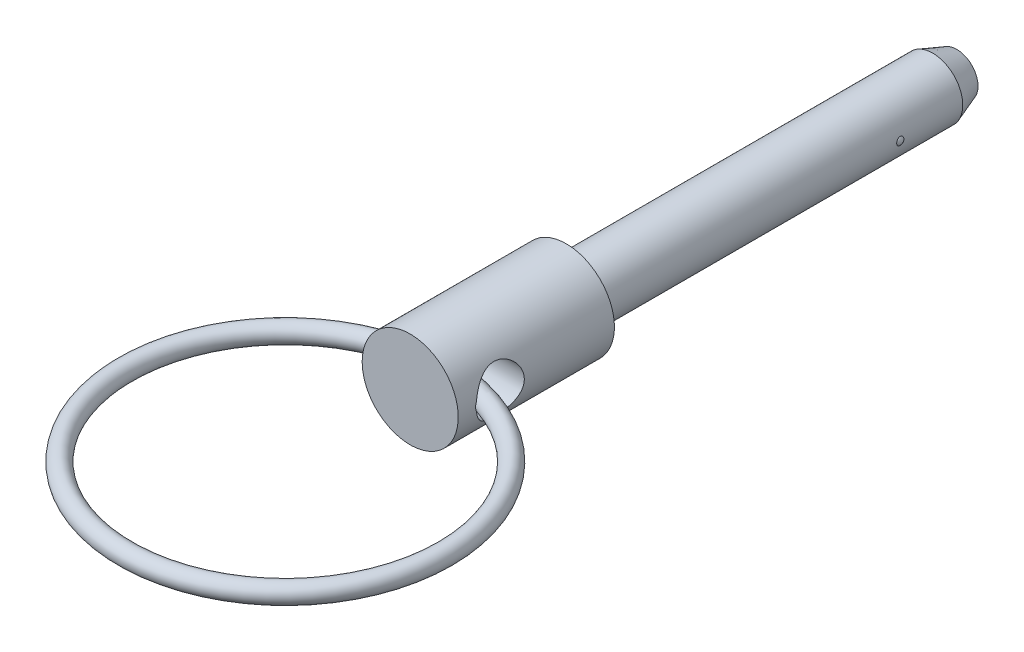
ISO-10303-21;
HEADER;
FILE_DESCRIPTION(('STEP AP214'),'2;1');
FILE_NAME('part.step','',(''),(''),'','','');
FILE_SCHEMA(('AUTOMOTIVE_DESIGN { 1 0 10303 214 1 1 1 1 }'));
ENDSEC;
DATA;
#1=APPLICATION_CONTEXT('core data for automotive mechanical design processes');
#2=APPLICATION_PROTOCOL_DEFINITION('international standard','automotive_design',2000,#1);
#3=PRODUCT_CONTEXT('',#1,'mechanical');
#4=PRODUCT('Part','Part','',(#3));
#5=PRODUCT_RELATED_PRODUCT_CATEGORY('part','',(#4));
#6=PRODUCT_DEFINITION_FORMATION('','',#4);
#7=PRODUCT_DEFINITION_CONTEXT('part definition',#1,'design');
#8=PRODUCT_DEFINITION('design','',#6,#7);
#9=PRODUCT_DEFINITION_SHAPE('','',#8);
#10=(LENGTH_UNIT() NAMED_UNIT(*) SI_UNIT(.MILLI.,.METRE.));
#11=(NAMED_UNIT(*) PLANE_ANGLE_UNIT() SI_UNIT($,.RADIAN.));
#12=(NAMED_UNIT(*) SI_UNIT($,.STERADIAN.) SOLID_ANGLE_UNIT());
#13=UNCERTAINTY_MEASURE_WITH_UNIT(LENGTH_MEASURE(1.E-05),#10,'distance_accuracy_value','');
#14=(GEOMETRIC_REPRESENTATION_CONTEXT(3) GLOBAL_UNCERTAINTY_ASSIGNED_CONTEXT((#13)) GLOBAL_UNIT_ASSIGNED_CONTEXT((#10,
#11,#12)) REPRESENTATION_CONTEXT('',''));
#15=CARTESIAN_POINT('',(0.,0.,0.));
#16=DIRECTION('',(0.,0.,1.));
#17=DIRECTION('',(1.,0.,0.));
#18=AXIS2_PLACEMENT_3D('',#15,#16,#17);
#19=CARTESIAN_POINT('',(0.,0.,14.9758741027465));
#20=DIRECTION('',(0.,0.,1.));
#21=DIRECTION('',(-1.,0.,0.));
#22=AXIS2_PLACEMENT_3D('',#19,#20,#21);
#23=CYLINDRICAL_SURFACE('',#22,4.00000000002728);
#24=CARTESIAN_POINT('',(0.,0.,12.9999999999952));
#25=DIRECTION('',(0.,0.,1.));
#26=DIRECTION('',(-1.,0.,0.));
#27=AXIS2_PLACEMENT_3D('',#24,#25,#26);
#28=CIRCLE('',#27,4.00000000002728);
#29=CARTESIAN_POINT('',(-4.00000000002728,0.,12.9999999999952));
#30=VERTEX_POINT('',#29);
#31=EDGE_CURVE('E61',#30,#30,#28,.T.);
#32=ORIENTED_EDGE('',*,*,#31,.F.);
#33=EDGE_LOOP('',(#32));
#34=FACE_BOUND('',#33,.T.);
#35=CARTESIAN_POINT('',(0.,0.,2.90531487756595E-11));
#36=DIRECTION('',(0.,0.,1.));
#37=DIRECTION('',(-1.,0.,0.));
#38=AXIS2_PLACEMENT_3D('',#35,#36,#37);
#39=CIRCLE('',#38,4.00000000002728);
#40=CARTESIAN_POINT('',(-4.00000000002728,0.,2.90531487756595E-11));
#41=VERTEX_POINT('',#40);
#42=EDGE_CURVE('E114',#41,#41,#39,.T.);
#43=ORIENTED_EDGE('',*,*,#42,.T.);
#44=EDGE_LOOP('',(#43));
#45=FACE_BOUND('',#44,.T.);
#46=CARTESIAN_POINT('',(3.99005038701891,0.281953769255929,9.92986493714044));
#47=CARTESIAN_POINT('',(3.98710361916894,0.323646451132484,9.94537015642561));
#48=CARTESIAN_POINT('',(3.98358785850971,0.364031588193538,9.96435084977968));
#49=CARTESIAN_POINT('',(3.97580260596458,0.441017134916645,10.008790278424));
#50=CARTESIAN_POINT('',(3.97153248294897,0.47761433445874,10.0342544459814));
#51=CARTESIAN_POINT('',(3.96271650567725,0.545954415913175,10.0909789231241));
#52=CARTESIAN_POINT('',(3.95817071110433,0.577698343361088,10.1222379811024));
#53=CARTESIAN_POINT('',(3.94931125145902,0.635450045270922,10.1896824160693));
#54=CARTESIAN_POINT('',(3.94499753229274,0.661459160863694,10.2258666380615));
#55=CARTESIAN_POINT('',(3.93708131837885,0.707055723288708,10.3020868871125));
#56=CARTESIAN_POINT('',(3.93347801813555,0.726650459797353,10.3421184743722));
#57=CARTESIAN_POINT('',(3.92735611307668,0.759043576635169,10.4249158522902));
#58=CARTESIAN_POINT('',(3.92483759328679,0.771841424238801,10.4676818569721));
#59=CARTESIAN_POINT('',(3.92109281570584,0.79064892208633,10.5555243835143));
#60=CARTESIAN_POINT('',(3.91989028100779,0.79653409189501,10.6006284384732));
#61=CARTESIAN_POINT('',(3.91894269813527,0.801182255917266,10.6912124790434));
#62=CARTESIAN_POINT('',(3.91919799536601,0.79994356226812,10.7366925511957));
#63=CARTESIAN_POINT('',(3.92114297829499,0.79035624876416,10.829192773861));
#64=CARTESIAN_POINT('',(3.92290466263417,0.781650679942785,10.8761742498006));
#65=CARTESIAN_POINT('',(3.92772482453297,0.757055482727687,10.9681516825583));
#66=CARTESIAN_POINT('',(3.93078377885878,0.741163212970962,11.0131469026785));
#67=CARTESIAN_POINT('',(3.93806499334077,0.70148030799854,11.1026764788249));
#68=CARTESIAN_POINT('',(3.94234583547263,0.677274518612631,11.1470226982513));
#69=CARTESIAN_POINT('',(3.95147153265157,0.621820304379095,11.2310343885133));
#70=CARTESIAN_POINT('',(3.95631656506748,0.590569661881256,11.2706983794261));
#71=CARTESIAN_POINT('',(3.9660181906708,0.5214609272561,11.3441933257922));
#72=CARTESIAN_POINT('',(3.97087472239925,0.483570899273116,11.3779944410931));
#73=CARTESIAN_POINT('',(3.97994547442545,0.402125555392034,11.4380257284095));
#74=CARTESIAN_POINT('',(3.98416017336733,0.358574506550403,11.4642615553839));
#75=CARTESIAN_POINT('',(3.99101820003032,0.271145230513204,11.5057266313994));
#76=CARTESIAN_POINT('',(3.99376828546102,0.227643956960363,11.5217298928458));
#77=CARTESIAN_POINT('',(3.9978554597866,0.138347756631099,11.5452375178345));
#78=CARTESIAN_POINT('',(3.99919394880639,0.0925551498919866,11.5527503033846));
#79=CARTESIAN_POINT('',(4.00020492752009,0.00564920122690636,11.5584330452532));
#80=CARTESIAN_POINT('',(4.00005022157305,-0.0354012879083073,11.5575719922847));
#81=CARTESIAN_POINT('',(3.99850330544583,-0.116721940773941,11.5488508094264));
#82=CARTESIAN_POINT('',(3.99711125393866,-0.156992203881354,11.5409915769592));
#83=CARTESIAN_POINT('',(3.99330536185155,-0.23447092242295,11.5190218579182));
#84=CARTESIAN_POINT('',(3.99092186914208,-0.271733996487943,11.5050965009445));
#85=CARTESIAN_POINT('',(3.98537855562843,-0.343596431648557,11.4716692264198));
#86=CARTESIAN_POINT('',(3.98221855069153,-0.378195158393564,11.4521659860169));
#87=CARTESIAN_POINT('',(3.97515535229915,-0.446551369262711,11.4066625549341));
#88=CARTESIAN_POINT('',(3.97121432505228,-0.48005403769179,11.380286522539));
#89=CARTESIAN_POINT('',(3.96314004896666,-0.542697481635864,11.3228119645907));
#90=CARTESIAN_POINT('',(3.95900671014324,-0.57183618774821,11.2917112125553));
#91=CARTESIAN_POINT('',(3.95044956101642,-0.628376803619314,11.2218573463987));
#92=CARTESIAN_POINT('',(3.94604615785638,-0.655204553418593,11.1826362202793));
#93=CARTESIAN_POINT('',(3.93791011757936,-0.702452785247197,11.1004353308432));
#94=CARTESIAN_POINT('',(3.93417778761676,-0.722870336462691,11.0574538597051));
#95=CARTESIAN_POINT('',(3.92755557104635,-0.758058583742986,10.9655943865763));
#96=CARTESIAN_POINT('',(3.92474503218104,-0.77232094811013,10.9165145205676));
#97=CARTESIAN_POINT('',(3.92073635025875,-0.792422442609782,10.8165862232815));
#98=CARTESIAN_POINT('',(3.91953811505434,-0.79826205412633,10.765737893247));
#99=CARTESIAN_POINT('',(3.91896964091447,-0.801049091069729,10.6645522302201));
#100=CARTESIAN_POINT('',(3.91957166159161,-0.798131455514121,10.6142190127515));
#101=CARTESIAN_POINT('',(3.92252995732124,-0.783463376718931,10.5149080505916));
#102=CARTESIAN_POINT('',(3.9248854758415,-0.771716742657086,10.4659297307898));
#103=CARTESIAN_POINT('',(3.93088557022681,-0.740520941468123,10.3740211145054));
#104=CARTESIAN_POINT('',(3.93443961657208,-0.721603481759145,10.3309041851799));
#105=CARTESIAN_POINT('',(3.94243966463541,-0.67652841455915,10.2487285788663));
#106=CARTESIAN_POINT('',(3.94688545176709,-0.650372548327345,10.2096689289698));
#107=CARTESIAN_POINT('',(3.95592540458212,-0.592842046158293,10.138445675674));
#108=CARTESIAN_POINT('',(3.96050463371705,-0.561744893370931,10.1060555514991));
#109=CARTESIAN_POINT('',(3.96946431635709,-0.494471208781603,10.0470379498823));
#110=CARTESIAN_POINT('',(3.97384478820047,-0.458295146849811,10.0204099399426));
#111=CARTESIAN_POINT('',(3.98187371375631,-0.382266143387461,9.97385565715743));
#112=CARTESIAN_POINT('',(3.98552868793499,-0.342451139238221,9.95386848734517));
#113=CARTESIAN_POINT('',(3.9917566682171,-0.259975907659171,9.92075319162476));
#114=CARTESIAN_POINT('',(3.99432946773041,-0.217315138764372,9.90762637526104));
#115=CARTESIAN_POINT('',(3.99811926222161,-0.130195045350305,9.88852098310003));
#116=CARTESIAN_POINT('',(3.99933102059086,-0.0857294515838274,9.88257000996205));
#117=CARTESIAN_POINT('',(4.00024701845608,0.00356373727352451,9.87805708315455));
#118=CARTESIAN_POINT('',(3.9999525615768,0.0483909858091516,9.8794887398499));
#119=CARTESIAN_POINT('',(3.99817522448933,0.125082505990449,9.88829599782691));
#120=CARTESIAN_POINT('',(3.99703656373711,0.157163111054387,9.8939529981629));
#121=CARTESIAN_POINT('',(3.99404982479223,0.220379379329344,9.90907748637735));
#122=CARTESIAN_POINT('',(3.9922017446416,0.251515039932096,9.91854498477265));
#123=CARTESIAN_POINT('',(3.99005038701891,0.281953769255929,9.92986493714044));
#124=B_SPLINE_CURVE_WITH_KNOTS('',3,(#46,#47,#48,#49,#50,#51,#52,#53,#54,#55,#56,#57,#58,#59,
#60,#61,#62,#63,#64,#65,#66,#67,#68,#69,#70,#71,#72,#73,#74,#75,#76,#77,#78,#79,#80,#81,#82,#83,
#84,#85,#86,#87,#88,#89,#90,#91,#92,#93,#94,#95,#96,#97,#98,#99,#100,#101,#102,#103,#104,#105,
#106,#107,#108,#109,#110,#111,#112,#113,#114,#115,#116,#117,#118,#119,#120,#121,#122,#123),
.UNSPECIFIED.,.T.,.F.,(4,2,2,2,2,2,2,2,2,2,2,2,2,2,2,2,2,2,2,2,2,2,2,2,2,2,2,2,2,2,2,2,2,2,2,2,
2,2,4),(0.,0.133622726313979,0.267357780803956,0.40106398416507,0.534738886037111,
0.668261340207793,0.801794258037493,0.937696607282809,1.07363115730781,1.2164509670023,
1.35932331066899,1.5107314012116,1.66218722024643,1.8143926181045,1.96648394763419,
2.1049852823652,2.24334911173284,2.36591145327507,2.488458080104,2.60750142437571,
2.72657302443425,2.85451767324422,2.98252280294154,3.12508196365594,3.26770620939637,
3.42053145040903,3.57334795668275,3.72382188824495,3.87423093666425,4.01516707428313,
4.15606933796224,4.29082406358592,4.42556633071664,4.55903651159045,4.69253216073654,
4.82653969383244,4.96043126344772,5.05798542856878,5.15553986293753),.UNSPECIFIED.);
#125=CARTESIAN_POINT('',(3.98515545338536,0.344290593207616,11.4701431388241));
#126=VERTEX_POINT('',#125);
#127=CARTESIAN_POINT('',(3.9851554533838,-0.344290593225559,11.4701431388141));
#128=VERTEX_POINT('',#127);
#129=EDGE_CURVE('E40',#126,#128,#124,.T.);
#130=ORIENTED_EDGE('',*,*,#129,.F.);
#131=CARTESIAN_POINT('',(3.46410161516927,-2.,9.5));
#132=CARTESIAN_POINT('',(3.46411185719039,-1.99999158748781,9.39578679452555));
#133=CARTESIAN_POINT('',(3.46887633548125,-1.99179963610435,9.29143782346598));
#134=CARTESIAN_POINT('',(3.48724701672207,-1.95944672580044,9.08594482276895));
#135=CARTESIAN_POINT('',(3.50087179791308,-1.93525221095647,8.98480799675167));
#136=CARTESIAN_POINT('',(3.53498701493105,-1.87219981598,8.78909684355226));
#137=CARTESIAN_POINT('',(3.55544089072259,-1.83341988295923,8.69449074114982));
#138=CARTESIAN_POINT('',(3.60085327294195,-1.74253507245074,8.51315154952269));
#139=CARTESIAN_POINT('',(3.62581202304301,-1.6904294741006,8.42641888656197));
#140=CARTESIAN_POINT('',(3.679937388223,-1.56933307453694,8.25538855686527));
#141=CARTESIAN_POINT('',(3.70928127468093,-1.49930407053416,8.1718817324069));
#142=CARTESIAN_POINT('',(3.76743965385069,-1.34650761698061,8.01718321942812));
#143=CARTESIAN_POINT('',(3.79625387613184,-1.26373385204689,7.94599767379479));
#144=CARTESIAN_POINT('',(3.8524295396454,-1.080979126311,7.81326569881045));
#145=CARTESIAN_POINT('',(3.879562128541,-0.980214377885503,7.75269246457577));
#146=CARTESIAN_POINT('',(3.92701512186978,-0.768314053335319,7.64971829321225));
#147=CARTESIAN_POINT('',(3.94733982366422,-0.657185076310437,7.60730588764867));
#148=CARTESIAN_POINT('',(3.97760922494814,-0.436089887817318,7.54499067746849));
#149=CARTESIAN_POINT('',(3.98818960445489,-0.326603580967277,7.52370094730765));
#150=CARTESIAN_POINT('',(4.00015167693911,-0.105141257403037,7.49966776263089));
#151=CARTESIAN_POINT('',(4.00153893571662,0.00683321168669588,7.49691308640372));
#152=CARTESIAN_POINT('',(3.99525963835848,0.21966504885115,7.50949334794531));
#153=CARTESIAN_POINT('',(3.98836991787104,0.320642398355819,7.5232760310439));
#154=CARTESIAN_POINT('',(3.96748490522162,0.51862754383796,7.56576168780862));
#155=CARTESIAN_POINT('',(3.95348908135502,0.615635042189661,7.59446577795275));
#156=CARTESIAN_POINT('',(3.91943166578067,0.804618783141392,7.66616513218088));
#157=CARTESIAN_POINT('',(3.89928883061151,0.896506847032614,7.70935262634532));
#158=CARTESIAN_POINT('',(3.85475291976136,1.07195360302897,7.80852683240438));
#159=CARTESIAN_POINT('',(3.83035832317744,1.15550929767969,7.86451812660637));
#160=CARTESIAN_POINT('',(3.77688788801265,1.32034732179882,7.99379070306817));
#161=CARTESIAN_POINT('',(3.74758751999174,1.40066815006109,8.06820605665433));
#162=CARTESIAN_POINT('',(3.68908681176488,1.54820874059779,8.22917944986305));
#163=CARTESIAN_POINT('',(3.65988656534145,1.6154184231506,8.31574674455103));
#164=CARTESIAN_POINT('',(3.60288312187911,1.73901066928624,8.50529638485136));
#165=CARTESIAN_POINT('',(3.57528639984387,1.79443462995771,8.60897204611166));
#166=CARTESIAN_POINT('',(3.52750900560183,1.88663822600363,8.82587534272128));
#167=CARTESIAN_POINT('',(3.50732060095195,1.92343731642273,8.9390928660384));
#168=CARTESIAN_POINT('',(3.47889271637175,1.97436042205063,9.1624290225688));
#169=CARTESIAN_POINT('',(3.46983311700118,1.99005024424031,9.27208223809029));
#170=CARTESIAN_POINT('',(3.46235838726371,2.00303389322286,9.49280268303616));
#171=CARTESIAN_POINT('',(3.46393573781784,2.00034071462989,9.60386885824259));
#172=CARTESIAN_POINT('',(3.47668673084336,1.97807208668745,9.81130783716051));
#173=CARTESIAN_POINT('',(3.48679175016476,1.96037563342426,9.90795890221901));
#174=CARTESIAN_POINT('',(3.51388043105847,1.91139256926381,10.0967355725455));
#175=CARTESIAN_POINT('',(3.5308663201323,1.88010155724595,10.1888597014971));
#176=CARTESIAN_POINT('',(3.57072444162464,1.80329517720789,10.370822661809));
#177=CARTESIAN_POINT('',(3.59383286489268,1.75718812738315,10.46035803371));
#178=CARTESIAN_POINT('',(3.64312238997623,1.65257412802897,10.6309385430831));
#179=CARTESIAN_POINT('',(3.66930506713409,1.59406080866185,10.7119792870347));
#180=CARTESIAN_POINT('',(3.72575996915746,1.45767433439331,10.8739575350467));
#181=CARTESIAN_POINT('',(3.75613166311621,1.37829054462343,10.9535943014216));
#182=CARTESIAN_POINT('',(3.81468469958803,1.20680899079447,11.0988244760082));
#183=CARTESIAN_POINT('',(3.84286530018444,1.11470694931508,11.1644131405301));
#184=CARTESIAN_POINT('',(3.89482723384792,0.917070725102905,11.2811474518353));
#185=CARTESIAN_POINT('',(3.91847283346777,0.811246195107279,11.3318662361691));
#186=CARTESIAN_POINT('',(3.95766709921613,0.591044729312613,11.4142758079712));
#187=CARTESIAN_POINT('',(3.97322287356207,0.476675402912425,11.4459833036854));
#188=CARTESIAN_POINT('',(3.99335016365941,0.253959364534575,11.4867371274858));
#189=CARTESIAN_POINT('',(3.99879855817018,0.146022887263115,11.4975957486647));
#190=CARTESIAN_POINT('',(4.00084260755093,-0.0702519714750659,11.5016865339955));
#191=CARTESIAN_POINT('',(3.99744136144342,-0.178590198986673,11.4949248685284));
#192=CARTESIAN_POINT('',(3.98267937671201,-0.385075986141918,11.4651671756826));
#193=CARTESIAN_POINT('',(3.97185789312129,-0.483424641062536,11.4432702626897));
#194=CARTESIAN_POINT('',(3.94384187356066,-0.674891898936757,11.3853460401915));
#195=CARTESIAN_POINT('',(3.92664642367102,-0.768009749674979,11.3493167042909));
#196=CARTESIAN_POINT('',(3.88651861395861,-0.950846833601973,11.2625457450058));
#197=CARTESIAN_POINT('',(3.86337234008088,-1.04025036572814,11.211240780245));
#198=CARTESIAN_POINT('',(3.81376266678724,-1.20954920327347,11.096084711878));
#199=CARTESIAN_POINT('',(3.78729774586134,-1.28944011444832,11.0322278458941));
#200=CARTESIAN_POINT('',(3.73057218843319,-1.44582833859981,10.8864033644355));
#201=CARTESIAN_POINT('',(3.70019591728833,-1.52119665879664,10.8032658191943));
#202=CARTESIAN_POINT('',(3.64126158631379,-1.65732528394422,10.6251077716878));
#203=CARTESIAN_POINT('',(3.6127051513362,-1.71807266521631,10.530076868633));
#204=CARTESIAN_POINT('',(3.55999186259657,-1.82486714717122,10.3266911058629));
#205=CARTESIAN_POINT('',(3.5360025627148,-1.8703890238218,10.2180100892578));
#206=CARTESIAN_POINT('',(3.50696218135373,-1.92395929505,10.0494218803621));
#207=CARTESIAN_POINT('',(3.49844389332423,-1.93935666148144,9.99235217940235));
#208=CARTESIAN_POINT('',(3.48406059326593,-1.96508069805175,9.87676744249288));
#209=CARTESIAN_POINT('',(3.47819372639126,-1.97541091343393,9.81825344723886));
#210=CARTESIAN_POINT('',(3.47059023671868,-1.9887293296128,9.71639921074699));
#211=CARTESIAN_POINT('',(3.46816389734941,-1.99295091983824,9.67326694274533));
#212=CARTESIAN_POINT('',(3.46491740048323,-1.99858810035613,9.5867643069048));
#213=CARTESIAN_POINT('',(3.46409735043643,-2.00000350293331,9.54339392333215));
#214=CARTESIAN_POINT('',(3.46410161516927,-2.,9.5));
#215=B_SPLINE_CURVE_WITH_KNOTS('',3,(#131,#132,#133,#134,#135,#136,#137,#138,#139,#140,#141,
#142,#143,#144,#145,#146,#147,#148,#149,#150,#151,#152,#153,#154,#155,#156,#157,#158,#159,#160,
#161,#162,#163,#164,#165,#166,#167,#168,#169,#170,#171,#172,#173,#174,#175,#176,#177,#178,#179,
#180,#181,#182,#183,#184,#185,#186,#187,#188,#189,#190,#191,#192,#193,#194,#195,#196,#197,#198,
#199,#200,#201,#202,#203,#204,#205,#206,#207,#208,#209,#210,#211,#212,#213,#214),.UNSPECIFIED.,
.T.,.F.,(4,2,2,2,2,2,2,2,2,2,2,2,2,2,2,2,2,2,2,2,2,2,2,2,2,2,2,2,2,2,2,2,2,2,2,2,2,2,2,2,2,4),
(0.,0.312464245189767,0.625585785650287,0.937057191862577,1.24854545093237,1.58572462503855,
1.92307142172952,2.283157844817,2.64301653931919,2.97726969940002,3.31132047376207,
3.61632194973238,3.92134625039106,4.23059069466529,4.53994598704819,4.87854382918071,
5.21740096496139,5.57777683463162,5.93777548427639,6.26924581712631,6.60048186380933,
6.89548366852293,7.19058104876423,7.49934592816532,7.80826972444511,8.15613487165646,
8.50411729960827,8.8612836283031,9.21813559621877,9.54224540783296,9.86624173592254,
10.1688884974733,10.4715786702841,10.7872150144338,11.1029966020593,11.4502048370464,
11.7977188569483,12.1562149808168,12.3351395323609,12.513938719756,12.6440387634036,
12.7741475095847),.UNSPECIFIED.);
#216=EDGE_CURVE('E52',#128,#126,#215,.T.);
#217=ORIENTED_EDGE('',*,*,#216,.F.);
#218=EDGE_LOOP('',(#130,#217));
#219=FACE_BOUND('',#218,.T.);
#220=CARTESIAN_POINT('',(-3.99005038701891,0.28195376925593,9.92986493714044));
#221=CARTESIAN_POINT('',(-3.99300741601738,0.240095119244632,9.91430139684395));
#222=CARTESIAN_POINT('',(-3.99539394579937,0.196873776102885,9.90222423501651));
#223=CARTESIAN_POINT('',(-3.99875840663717,0.10894998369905,9.88535960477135));
#224=CARTESIAN_POINT('',(-3.99973502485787,0.0642461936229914,9.88057893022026));
#225=CARTESIAN_POINT('',(-4.00017032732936,-0.025331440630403,9.87843698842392));
#226=CARTESIAN_POINT('',(-3.99962961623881,-0.0702052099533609,9.88107276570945));
#227=CARTESIAN_POINT('',(-3.99709040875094,-0.158855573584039,9.89369477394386));
#228=CARTESIAN_POINT('',(-3.99509218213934,-0.202632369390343,9.90367964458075));
#229=CARTESIAN_POINT('',(-3.9898570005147,-0.287863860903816,9.93075746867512));
#230=CARTESIAN_POINT('',(-3.98661975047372,-0.329318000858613,9.94785211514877));
#231=CARTESIAN_POINT('',(-3.97926488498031,-0.408707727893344,9.98872052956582));
#232=CARTESIAN_POINT('',(-3.97514726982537,-0.446643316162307,10.0124942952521));
#233=CARTESIAN_POINT('',(-3.96650501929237,-0.517804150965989,10.0660180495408));
#234=CARTESIAN_POINT('',(-3.96198162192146,-0.551042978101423,10.0957501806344));
#235=CARTESIAN_POINT('',(-3.95302385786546,-0.612008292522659,10.1604189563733));
#236=CARTESIAN_POINT('',(-3.94858948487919,-0.639735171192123,10.1953552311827));
#237=CARTESIAN_POINT('',(-3.94031345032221,-0.688877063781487,10.2693392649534));
#238=CARTESIAN_POINT('',(-3.93647024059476,-0.710308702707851,10.3083758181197));
#239=CARTESIAN_POINT('',(-3.92977370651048,-0.746470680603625,10.3895111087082));
#240=CARTESIAN_POINT('',(-3.92692040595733,-0.761200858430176,10.4316099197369));
#241=CARTESIAN_POINT('',(-3.92245555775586,-0.783887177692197,10.5182713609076));
#242=CARTESIAN_POINT('',(-3.92086162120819,-0.791747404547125,10.5628599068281));
#243=CARTESIAN_POINT('',(-3.91911143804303,-0.800365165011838,10.652740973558));
#244=CARTESIAN_POINT('',(-3.91895550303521,-0.80112115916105,10.698033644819));
#245=CARTESIAN_POINT('',(-3.92007796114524,-0.795611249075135,10.7902748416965));
#246=CARTESIAN_POINT('',(-3.92142316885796,-0.789018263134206,10.837202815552));
#247=CARTESIAN_POINT('',(-3.92546548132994,-0.768652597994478,10.9294151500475));
#248=CARTESIAN_POINT('',(-3.92816306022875,-0.754877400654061,10.9746989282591));
#249=CARTESIAN_POINT('',(-3.93479992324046,-0.719508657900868,11.0652695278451));
#250=CARTESIAN_POINT('',(-3.93880557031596,-0.697485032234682,11.1103840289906));
#251=CARTESIAN_POINT('',(-3.94752061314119,-0.646337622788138,11.196342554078));
#252=CARTESIAN_POINT('',(-3.95223026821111,-0.617211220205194,11.2371849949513));
#253=CARTESIAN_POINT('',(-3.96188534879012,-0.551879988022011,11.3139586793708));
#254=CARTESIAN_POINT('',(-3.96683340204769,-0.515564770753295,11.349796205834));
#255=CARTESIAN_POINT('',(-3.97625988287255,-0.436941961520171,11.414255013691));
#256=CARTESIAN_POINT('',(-3.98073857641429,-0.394637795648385,11.4428803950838));
#257=CARTESIAN_POINT('',(-3.98829005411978,-0.30863677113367,11.4895001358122));
#258=CARTESIAN_POINT('',(-3.99144495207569,-0.265302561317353,11.5081469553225));
#259=CARTESIAN_POINT('',(-3.99638413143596,-0.175817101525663,11.5368761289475));
#260=CARTESIAN_POINT('',(-3.99816989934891,-0.129668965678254,11.5469677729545));
#261=CARTESIAN_POINT('',(-3.99999419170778,-0.0417967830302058,11.5572584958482));
#262=CARTESIAN_POINT('',(-4.00021432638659,-0.000194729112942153,11.5584860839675));
#263=CARTESIAN_POINT('',(-3.99936155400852,0.0825703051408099,11.5536924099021));
#264=CARTESIAN_POINT('',(-3.9982889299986,0.123733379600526,11.5476727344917));
#265=CARTESIAN_POINT('',(-3.99505363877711,0.202575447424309,11.5291543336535));
#266=CARTESIAN_POINT('',(-3.99294152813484,0.24032798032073,11.5169554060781));
#267=CARTESIAN_POINT('',(-3.98787194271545,0.31340150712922,11.4868260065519));
#268=CARTESIAN_POINT('',(-3.98491430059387,0.348722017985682,11.4688943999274));
#269=CARTESIAN_POINT('',(-3.97822434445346,0.418368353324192,11.4267056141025));
#270=CARTESIAN_POINT('',(-3.9744550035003,0.452491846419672,11.4021214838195));
#271=CARTESIAN_POINT('',(-3.96662805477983,0.516631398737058,11.3481231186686));
#272=CARTESIAN_POINT('',(-3.96257031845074,0.546645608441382,11.3187067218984));
#273=CARTESIAN_POINT('',(-3.9540631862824,0.605276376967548,11.2522992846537));
#274=CARTESIAN_POINT('',(-3.94962143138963,0.633350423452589,11.214827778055));
#275=CARTESIAN_POINT('',(-3.9412701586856,0.68339933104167,11.135950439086));
#276=CARTESIAN_POINT('',(-3.93736090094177,0.705371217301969,11.0945427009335));
#277=CARTESIAN_POINT('',(-3.93019522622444,0.744305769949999,11.0052774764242));
#278=CARTESIAN_POINT('',(-3.9270182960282,0.760712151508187,10.9571694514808));
#279=CARTESIAN_POINT('',(-3.92216984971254,0.785329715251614,10.8588172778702));
#280=CARTESIAN_POINT('',(-3.92049838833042,0.793540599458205,10.8085730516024));
#281=CARTESIAN_POINT('',(-3.91892501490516,0.801276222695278,10.7075574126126));
#282=CARTESIAN_POINT('',(-3.91901674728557,0.800832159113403,10.6567885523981));
#283=CARTESIAN_POINT('',(-3.92100845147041,0.791023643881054,10.5561554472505));
#284=CARTESIAN_POINT('',(-3.9229076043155,0.7816632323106,10.5062908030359));
#285=CARTESIAN_POINT('',(-3.9281461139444,0.754877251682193,10.4121456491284));
#286=CARTESIAN_POINT('',(-3.93139064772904,0.737977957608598,10.3677100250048));
#287=CARTESIAN_POINT('',(-3.93892368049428,0.696648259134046,10.2825763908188));
#288=CARTESIAN_POINT('',(-3.94321208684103,0.672218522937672,10.2418780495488));
#289=CARTESIAN_POINT('',(-3.95208501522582,0.617853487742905,10.1674080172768));
#290=CARTESIAN_POINT('',(-3.95664517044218,0.588241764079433,10.1333964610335));
#291=CARTESIAN_POINT('',(-3.96570971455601,0.523645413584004,10.0709664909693));
#292=CARTESIAN_POINT('',(-3.97021415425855,0.488666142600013,10.0425425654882));
#293=CARTESIAN_POINT('',(-3.97742706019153,0.425180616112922,9.99940040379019));
#294=CARTESIAN_POINT('',(-3.9802769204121,0.39774932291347,9.98310007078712));
#295=CARTESIAN_POINT('',(-3.98553180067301,0.341095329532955,9.95389443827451));
#296=CARTESIAN_POINT('',(-3.9879368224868,0.311872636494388,9.94098912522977));
#297=CARTESIAN_POINT('',(-3.99005038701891,0.28195376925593,9.92986493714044));
#298=B_SPLINE_CURVE_WITH_KNOTS('',3,(#220,#221,#222,#223,#224,#225,#226,#227,#228,#229,#230,
#231,#232,#233,#234,#235,#236,#237,#238,#239,#240,#241,#242,#243,#244,#245,#246,#247,#248,#249,
#250,#251,#252,#253,#254,#255,#256,#257,#258,#259,#260,#261,#262,#263,#264,#265,#266,#267,#268,
#269,#270,#271,#272,#273,#274,#275,#276,#277,#278,#279,#280,#281,#282,#283,#284,#285,#286,#287,
#288,#289,#290,#291,#292,#293,#294,#295,#296,#297),.UNSPECIFIED.,.T.,.F.,(4,2,2,2,2,2,2,2,2,2,2,
2,2,2,2,2,2,2,2,2,2,2,2,2,2,2,2,2,2,2,2,2,2,2,2,2,2,2,4),(0.,0.134152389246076,
0.268429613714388,0.402653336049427,0.536852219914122,0.671083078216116,0.805313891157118,
0.939148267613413,1.07297313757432,1.20644134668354,1.33991276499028,1.4752191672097,
1.61055488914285,1.75216328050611,1.89382135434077,2.04422271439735,2.19467961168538,
2.34765655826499,2.50054634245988,2.64157513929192,2.78245059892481,2.90667081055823,
3.03086382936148,3.14953805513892,3.26823578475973,3.39440010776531,3.52062102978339,
3.66112536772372,3.80169808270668,3.95376166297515,4.10583077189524,4.25735183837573,
4.4088042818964,4.55102684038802,4.6932367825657,4.82856596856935,4.96376098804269,
5.05964806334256,5.15553475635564),.UNSPECIFIED.);
#299=CARTESIAN_POINT('',(-3.98515545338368,-0.344290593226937,11.4701431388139));
#300=VERTEX_POINT('',#299);
#301=CARTESIAN_POINT('',(-3.98515545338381,0.344290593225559,11.4701431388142));
#302=VERTEX_POINT('',#301);
#303=EDGE_CURVE('E56',#300,#302,#298,.T.);
#304=ORIENTED_EDGE('',*,*,#303,.F.);
#305=CARTESIAN_POINT('',(-4.00000000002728,0.,7.5));
#306=CARTESIAN_POINT('',(-3.9999942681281,-0.105143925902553,7.50000660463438));
#307=CARTESIAN_POINT('',(-3.99580982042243,-0.2104131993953,7.50834014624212));
#308=CARTESIAN_POINT('',(-3.97948312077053,-0.417840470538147,7.54130576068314));
#309=CARTESIAN_POINT('',(-3.96732575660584,-0.519992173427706,7.56596878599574));
#310=CARTESIAN_POINT('',(-3.93632558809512,-0.717867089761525,7.63038761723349));
#311=CARTESIAN_POINT('',(-3.91750878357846,-0.81361360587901,7.67008476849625));
#312=CARTESIAN_POINT('',(-3.87491553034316,-0.996945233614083,7.76314124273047));
#313=CARTESIAN_POINT('',(-3.85113947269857,-1.08453098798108,7.81649948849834));
#314=CARTESIAN_POINT('',(-3.79912516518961,-1.25501563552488,7.93903449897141));
#315=CARTESIAN_POINT('',(-3.7707039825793,-1.33731042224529,8.00897295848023));
#316=CARTESIAN_POINT('',(-3.71319940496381,-1.48955888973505,8.16104295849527));
#317=CARTESIAN_POINT('',(-3.68411552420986,-1.55950316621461,8.24318370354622));
#318=CARTESIAN_POINT('',(-3.6259790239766,-1.6905040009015,8.42496669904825));
#319=CARTESIAN_POINT('',(-3.59710373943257,-1.75045067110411,8.52547219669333));
#320=CARTESIAN_POINT('',(-3.54571957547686,-1.852336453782,8.73673467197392));
#321=CARTESIAN_POINT('',(-3.5232061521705,-1.89428842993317,8.84748425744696));
#322=CARTESIAN_POINT('',(-3.48915734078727,-1.95626488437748,9.06933021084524));
#323=CARTESIAN_POINT('',(-3.47704543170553,-1.9774517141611,9.18000890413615));
#324=CARTESIAN_POINT('',(-3.46363779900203,-2.00085398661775,9.40395767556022));
#325=CARTESIAN_POINT('',(-3.46233138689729,-2.00308817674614,9.51722508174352));
#326=CARTESIAN_POINT('',(-3.4702186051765,-1.98937457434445,9.72857204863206));
#327=CARTESIAN_POINT('',(-3.47817527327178,-1.97556911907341,9.82684806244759));
#328=CARTESIAN_POINT('',(-3.50152457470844,-1.93387969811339,10.0194438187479));
#329=CARTESIAN_POINT('',(-3.51691957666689,-1.90599124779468,10.1137622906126));
#330=CARTESIAN_POINT('',(-3.55374952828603,-1.83641956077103,10.2984582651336));
#331=CARTESIAN_POINT('',(-3.57531681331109,-1.79443013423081,10.388692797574));
#332=CARTESIAN_POINT('',(-3.62206808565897,-1.69808337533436,10.5612685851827));
#333=CARTESIAN_POINT('',(-3.64725369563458,-1.64372048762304,10.6436062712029));
#334=CARTESIAN_POINT('',(-3.70226315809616,-1.51613210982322,10.8090425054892));
#335=CARTESIAN_POINT('',(-3.73227020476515,-1.441388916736,10.890913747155));
#336=CARTESIAN_POINT('',(-3.79095246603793,-1.2791111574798,11.0414708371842));
#337=CARTESIAN_POINT('',(-3.81962703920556,-1.19157051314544,11.1101503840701));
#338=CARTESIAN_POINT('',(-3.87403974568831,-1.00103301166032,11.2353713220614));
#339=CARTESIAN_POINT('',(-3.89957968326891,-0.897507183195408,11.2912009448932));
#340=CARTESIAN_POINT('',(-3.94315762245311,-0.680932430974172,11.3841940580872));
#341=CARTESIAN_POINT('',(-3.96120157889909,-0.567891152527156,11.4213723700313));
#342=CARTESIAN_POINT('',(-3.98648667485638,-0.345532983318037,11.4729508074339));
#343=CARTESIAN_POINT('',(-3.99449876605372,-0.236683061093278,11.488982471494));
#344=CARTESIAN_POINT('',(-4.00146026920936,-0.0175591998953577,11.502929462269));
#345=CARTESIAN_POINT('',(-4.00041397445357,0.0927140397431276,11.5008533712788));
#346=CARTESIAN_POINT('',(-3.98982384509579,0.302465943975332,11.479586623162));
#347=CARTESIAN_POINT('',(-3.98094491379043,0.402118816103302,11.4617349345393));
#348=CARTESIAN_POINT('',(-3.95644342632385,0.596813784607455,11.4115238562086));
#349=CARTESIAN_POINT('',(-3.94082012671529,0.691855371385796,11.3791628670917));
#350=CARTESIAN_POINT('',(-3.90368502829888,0.877777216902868,11.3000030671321));
#351=CARTESIAN_POINT('',(-3.88201763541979,0.968460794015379,11.2528178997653));
#352=CARTESIAN_POINT('',(-3.83487948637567,1.14092272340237,11.1457849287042));
#353=CARTESIAN_POINT('',(-3.80940711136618,1.22269725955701,11.0859317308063));
#354=CARTESIAN_POINT('',(-3.75416442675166,1.38353537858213,10.948479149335));
#355=CARTESIAN_POINT('',(-3.72421769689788,1.46154415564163,10.8697142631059));
#356=CARTESIAN_POINT('',(-3.66524783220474,1.60371264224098,10.7001496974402));
#357=CARTESIAN_POINT('',(-3.63622534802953,1.66786277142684,10.6093417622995));
#358=CARTESIAN_POINT('',(-3.58102384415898,1.7834158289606,10.412712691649));
#359=CARTESIAN_POINT('',(-3.55505059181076,1.83405099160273,10.306377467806));
#360=CARTESIAN_POINT('',(-3.51148144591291,1.91616565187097,10.0849798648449));
#361=CARTESIAN_POINT('',(-3.49387476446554,1.94766983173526,9.96992894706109));
#362=CARTESIAN_POINT('',(-3.47123002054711,1.98772337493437,9.74617955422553));
#363=CARTESIAN_POINT('',(-3.46514766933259,1.99818599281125,9.6379314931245));
#364=CARTESIAN_POINT('',(-3.46330709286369,2.00137830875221,9.42110586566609));
#365=CARTESIAN_POINT('',(-3.46754439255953,1.99411569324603,9.31252846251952));
#366=CARTESIAN_POINT('',(-3.48475724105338,1.96385225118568,9.10903299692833));
#367=CARTESIAN_POINT('',(-3.49686188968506,1.94241662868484,9.01379905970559));
#368=CARTESIAN_POINT('',(-3.52742032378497,1.88635071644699,8.8283837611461));
#369=CARTESIAN_POINT('',(-3.54587615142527,1.85171618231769,8.73820403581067));
#370=CARTESIAN_POINT('',(-3.58857060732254,1.76763149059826,8.55875029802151));
#371=CARTESIAN_POINT('',(-3.61311444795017,1.71734227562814,8.46994419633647));
#372=CARTESIAN_POINT('',(-3.66470663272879,1.60430194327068,8.30145092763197));
#373=CARTESIAN_POINT('',(-3.69175627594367,1.54154434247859,8.22176853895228));
#374=CARTESIAN_POINT('',(-3.74924646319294,1.3964066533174,8.06371603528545));
#375=CARTESIAN_POINT('',(-3.77969966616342,1.31256884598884,7.98668179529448));
#376=CARTESIAN_POINT('',(-3.83755504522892,1.13230961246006,7.84747403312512));
#377=CARTESIAN_POINT('',(-3.86495557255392,1.03588144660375,7.78530852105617));
#378=CARTESIAN_POINT('',(-3.91396019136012,0.831863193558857,7.67752727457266));
#379=CARTESIAN_POINT('',(-3.93552192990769,0.724199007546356,7.63203166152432));
#380=CARTESIAN_POINT('',(-3.97002682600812,0.501484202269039,7.56038366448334));
#381=CARTESIAN_POINT('',(-3.98299446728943,0.386455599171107,7.53417630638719));
#382=CARTESIAN_POINT('',(-3.9939092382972,0.225203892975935,7.51220517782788));
#383=CARTESIAN_POINT('',(-3.99618730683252,0.180323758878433,7.50763471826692));
#384=CARTESIAN_POINT('',(-3.99923393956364,0.0903034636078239,7.50153066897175));
#385=CARTESIAN_POINT('',(-4.0000024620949,0.0451632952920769,7.49999716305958));
#386=CARTESIAN_POINT('',(-4.00000000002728,0.,7.5));
#387=B_SPLINE_CURVE_WITH_KNOTS('',3,(#305,#306,#307,#308,#309,#310,#311,#312,#313,#314,#315,
#316,#317,#318,#319,#320,#321,#322,#323,#324,#325,#326,#327,#328,#329,#330,#331,#332,#333,#334,
#335,#336,#337,#338,#339,#340,#341,#342,#343,#344,#345,#346,#347,#348,#349,#350,#351,#352,#353,
#354,#355,#356,#357,#358,#359,#360,#361,#362,#363,#364,#365,#366,#367,#368,#369,#370,#371,#372,
#373,#374,#375,#376,#377,#378,#379,#380,#381,#382,#383,#384,#385,#386),.UNSPECIFIED.,.T.,.F.,(4,
2,2,2,2,2,2,2,2,2,2,2,2,2,2,2,2,2,2,2,2,2,2,2,2,2,2,2,2,2,2,2,2,2,2,2,2,2,2,2,4),(0.,
0.315248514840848,0.631096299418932,0.945724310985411,1.26032752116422,1.59396351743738,
1.92785247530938,2.28763452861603,2.64715895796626,2.98516024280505,3.3228271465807,
3.62011424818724,3.91749607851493,4.22180480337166,4.52625042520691,4.86929882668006,
5.21251069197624,5.57166044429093,5.93052433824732,6.25966580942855,6.58865129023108,
6.89213813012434,7.19565843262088,7.50785712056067,7.82018901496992,8.16319221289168,
8.5064317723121,8.86629364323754,9.22569023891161,9.55058615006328,9.87534119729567,
10.1691586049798,10.4630705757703,10.7767291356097,11.0905512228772,11.4425048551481,
11.7946476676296,12.1492802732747,12.5028981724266,12.6383056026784,12.7737167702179),.UNSPECIFIED.);
#388=EDGE_CURVE('E59',#302,#300,#387,.T.);
#389=ORIENTED_EDGE('',*,*,#388,.F.);
#390=EDGE_LOOP('',(#304,#389));
#391=FACE_BOUND('',#390,.T.);
#392=ADVANCED_FACE('F14',(#34,#45,#219,#391),#23,.T.);
#393=CARTESIAN_POINT('',(5.,0.,9.5));
#394=DIRECTION('',(-1.,0.,0.));
#395=DIRECTION('',(0.,-1.,0.));
#396=AXIS2_PLACEMENT_3D('',#393,#394,#395);
#397=CYLINDRICAL_SURFACE('',#396,2.);
#398=ORIENTED_EDGE('',*,*,#388,.T.);
#399=CARTESIAN_POINT('',(-4.01108315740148,-0.369511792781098,11.4655688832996));
#400=CARTESIAN_POINT('',(-3.99021138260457,-0.350083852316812,11.4692147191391));
#401=CARTESIAN_POINT('',(-3.97024619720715,-0.329516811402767,11.4727888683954));
#402=CARTESIAN_POINT('',(-3.93275440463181,-0.28567846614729,11.4796199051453));
#403=CARTESIAN_POINT('',(-3.91527020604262,-0.26237031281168,11.4828710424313));
#404=CARTESIAN_POINT('',(-3.88395406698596,-0.213038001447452,11.4887768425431));
#405=CARTESIAN_POINT('',(-3.87014971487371,-0.186995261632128,11.4914269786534));
#406=CARTESIAN_POINT('',(-3.84773626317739,-0.132819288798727,11.4957673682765));
#407=CARTESIAN_POINT('',(-3.83909292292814,-0.10470125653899,11.4974639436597));
#408=CARTESIAN_POINT('',(-3.82934402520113,-0.0542447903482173,11.4993828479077));
#409=CARTESIAN_POINT('',(-3.82691371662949,-0.0321704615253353,11.499863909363));
#410=CARTESIAN_POINT('',(-3.82579163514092,0.0120958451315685,11.500085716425));
#411=CARTESIAN_POINT('',(-3.8271019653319,0.0342878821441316,11.4998260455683));
#412=CARTESIAN_POINT('',(-3.83333881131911,0.0780566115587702,11.498595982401));
#413=CARTESIAN_POINT('',(-3.83825432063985,0.0996349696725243,11.4976277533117));
#414=CARTESIAN_POINT('',(-3.85128325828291,0.141760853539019,11.4950816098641));
#415=CARTESIAN_POINT('',(-3.85939921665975,0.162307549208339,11.4935032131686));
#416=CARTESIAN_POINT('',(-3.88251041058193,0.210921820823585,11.489056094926));
#417=CARTESIAN_POINT('',(-3.89895987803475,0.2382710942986,11.4859257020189));
#418=CARTESIAN_POINT('',(-3.93589373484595,0.289965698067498,11.4790416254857));
#419=CARTESIAN_POINT('',(-3.95638428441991,0.314306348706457,11.4752869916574));
#420=CARTESIAN_POINT('',(-3.98891907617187,0.348315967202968,11.4694667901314));
#421=CARTESIAN_POINT('',(-3.99986593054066,0.359074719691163,11.467529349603));
#422=CARTESIAN_POINT('',(-4.01108315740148,0.369511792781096,11.4655688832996));
#423=B_SPLINE_CURVE_WITH_KNOTS('',3,(#399,#400,#401,#402,#403,#404,#405,#406,#407,#408,#409,
#410,#411,#412,#413,#414,#415,#416,#417,#418,#419,#420,#421,#422),.UNSPECIFIED.,.F.,.F.,(4,2,2,
2,2,2,2,2,2,2,2,4),(0.,0.0863607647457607,0.174054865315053,0.262389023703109,0.350130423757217,
0.416459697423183,0.482826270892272,0.548991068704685,0.615208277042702,0.710869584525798,
0.806677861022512,0.853049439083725),.UNSPECIFIED.);
#424=EDGE_CURVE('E33',#300,#302,#423,.T.);
#425=ORIENTED_EDGE('',*,*,#424,.T.);
#426=EDGE_LOOP('',(#398,#425));
#427=FACE_BOUND('',#426,.T.);
#428=ORIENTED_EDGE('',*,*,#216,.T.);
#429=CARTESIAN_POINT('',(4.01108315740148,0.369511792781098,11.4655688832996));
#430=CARTESIAN_POINT('',(3.99021138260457,0.350083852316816,11.4692147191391));
#431=CARTESIAN_POINT('',(3.97024619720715,0.32951681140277,11.4727888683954));
#432=CARTESIAN_POINT('',(3.93275440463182,0.285678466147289,11.4796199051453));
#433=CARTESIAN_POINT('',(3.91527020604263,0.262370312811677,11.4828710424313));
#434=CARTESIAN_POINT('',(3.88395406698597,0.213038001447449,11.4887768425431));
#435=CARTESIAN_POINT('',(3.87014971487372,0.186995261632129,11.4914269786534));
#436=CARTESIAN_POINT('',(3.84773626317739,0.132819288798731,11.4957673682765));
#437=CARTESIAN_POINT('',(3.83909292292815,0.104701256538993,11.4974639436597));
#438=CARTESIAN_POINT('',(3.82934402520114,0.0542447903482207,11.4993828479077));
#439=CARTESIAN_POINT('',(3.8269137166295,0.0321704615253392,11.499863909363));
#440=CARTESIAN_POINT('',(3.82579163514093,-0.0120958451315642,11.500085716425));
#441=CARTESIAN_POINT('',(3.82710196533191,-0.0342878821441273,11.4998260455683));
#442=CARTESIAN_POINT('',(3.83333881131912,-0.0780566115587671,11.498595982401));
#443=CARTESIAN_POINT('',(3.83825432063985,-0.0996349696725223,11.4976277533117));
#444=CARTESIAN_POINT('',(3.8512832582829,-0.141760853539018,11.4950816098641));
#445=CARTESIAN_POINT('',(3.85939921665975,-0.162307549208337,11.4935032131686));
#446=CARTESIAN_POINT('',(3.88251041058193,-0.210921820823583,11.489056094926));
#447=CARTESIAN_POINT('',(3.89895987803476,-0.238271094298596,11.4859257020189));
#448=CARTESIAN_POINT('',(3.93589373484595,-0.289965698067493,11.4790416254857));
#449=CARTESIAN_POINT('',(3.95638428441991,-0.314306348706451,11.4752869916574));
#450=CARTESIAN_POINT('',(3.98891907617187,-0.348315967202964,11.4694667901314));
#451=CARTESIAN_POINT('',(3.99986593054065,-0.35907471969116,11.467529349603));
#452=CARTESIAN_POINT('',(4.01108315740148,-0.369511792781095,11.4655688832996));
#453=B_SPLINE_CURVE_WITH_KNOTS('',3,(#429,#430,#431,#432,#433,#434,#435,#436,#437,#438,#439,
#440,#441,#442,#443,#444,#445,#446,#447,#448,#449,#450,#451,#452),.UNSPECIFIED.,.F.,.F.,(4,2,2,
2,2,2,2,2,2,2,2,4),(0.,0.0863607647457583,0.17405486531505,0.262389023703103,0.350130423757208,
0.416459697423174,0.482826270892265,0.548991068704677,0.615208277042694,0.710869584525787,
0.806677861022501,0.853049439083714),.UNSPECIFIED.);
#454=EDGE_CURVE('E46',#126,#128,#453,.T.);
#455=ORIENTED_EDGE('',*,*,#454,.T.);
#456=EDGE_LOOP('',(#428,#455));
#457=FACE_BOUND('',#456,.T.);
#458=ADVANCED_FACE('F58',(#427,#457),#397,.F.);
#459=CARTESIAN_POINT('',(0.,0.,14.9758741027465));
#460=DIRECTION('',(0.,0.,1.));
#461=DIRECTION('',(-1.,0.,0.));
#462=AXIS2_PLACEMENT_3D('',#459,#460,#461);
#463=CYLINDRICAL_SURFACE('',#462,2.4999797);
#464=CARTESIAN_POINT('',(2.47854667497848,-0.326657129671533,-25.30003045));
#465=CARTESIAN_POINT('',(2.47854700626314,-0.326655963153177,-25.3164932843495));
#466=CARTESIAN_POINT('',(2.47874269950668,-0.325180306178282,-25.3329729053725));
#467=CARTESIAN_POINT('',(2.479501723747,-0.31933985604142,-25.3654189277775));
#468=CARTESIAN_POINT('',(2.48006564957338,-0.314970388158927,-25.3813844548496));
#469=CARTESIAN_POINT('',(2.48148901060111,-0.30355152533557,-25.4122606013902));
#470=CARTESIAN_POINT('',(2.48234765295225,-0.296509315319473,-25.4271739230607));
#471=CARTESIAN_POINT('',(2.48426009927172,-0.280033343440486,-25.4555892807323));
#472=CARTESIAN_POINT('',(2.48531386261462,-0.27060007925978,-25.4690916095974));
#473=CARTESIAN_POINT('',(2.48750023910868,-0.249701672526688,-25.4943611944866));
#474=CARTESIAN_POINT('',(2.48863269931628,-0.238240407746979,-25.5061316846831));
#475=CARTESIAN_POINT('',(2.49086582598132,-0.21363174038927,-25.5277524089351));
#476=CARTESIAN_POINT('',(2.49196648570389,-0.200483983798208,-25.5376022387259));
#477=CARTESIAN_POINT('',(2.49411877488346,-0.171737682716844,-25.5559476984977));
#478=CARTESIAN_POINT('',(2.49515918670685,-0.156026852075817,-25.5642686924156));
#479=CARTESIAN_POINT('',(2.49698106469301,-0.123490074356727,-25.5783717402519));
#480=CARTESIAN_POINT('',(2.49776243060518,-0.106663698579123,-25.5841528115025));
#481=CARTESIAN_POINT('',(2.49903703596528,-0.0710736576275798,-25.5934285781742));
#482=CARTESIAN_POINT('',(2.49950533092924,-0.0522579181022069,-25.5967275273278));
#483=CARTESIAN_POINT('',(2.50001059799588,-0.0143339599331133,-25.6002822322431));
#484=CARTESIAN_POINT('',(2.50004745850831,0.00477433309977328,-25.6005372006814));
#485=CARTESIAN_POINT('',(2.49967861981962,0.0435338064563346,-25.5979493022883));
#486=CARTESIAN_POINT('',(2.4992554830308,0.0631768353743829,-25.594984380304));
#487=CARTESIAN_POINT('',(2.49798548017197,0.101676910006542,-25.5857987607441));
#488=CARTESIAN_POINT('',(2.49713858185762,0.120533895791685,-25.5795778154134));
#489=CARTESIAN_POINT('',(2.49512848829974,0.156708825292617,-25.564043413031));
#490=CARTESIAN_POINT('',(2.49396828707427,0.174039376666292,-25.554759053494));
#491=CARTESIAN_POINT('',(2.49146927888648,0.206757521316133,-25.5332467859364));
#492=CARTESIAN_POINT('',(2.49013052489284,0.222145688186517,-25.5210197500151));
#493=CARTESIAN_POINT('',(2.48752981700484,0.249545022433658,-25.4946883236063));
#494=CARTESIAN_POINT('',(2.48626792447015,0.261700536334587,-25.480734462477));
#495=CARTESIAN_POINT('',(2.48390693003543,0.283236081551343,-25.450814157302));
#496=CARTESIAN_POINT('',(2.48280772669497,0.292617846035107,-25.434848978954));
#497=CARTESIAN_POINT('',(2.48100672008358,0.307499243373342,-25.4028228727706));
#498=CARTESIAN_POINT('',(2.48027911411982,0.313260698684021,-25.3868849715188));
#499=CARTESIAN_POINT('',(2.47918259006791,0.321824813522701,-25.3542223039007));
#500=CARTESIAN_POINT('',(2.47881349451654,0.324628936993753,-25.3374979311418));
#501=CARTESIAN_POINT('',(2.47849376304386,0.327060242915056,-25.3049667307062));
#502=CARTESIAN_POINT('',(2.47851631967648,0.326890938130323,-25.2891750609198));
#503=CARTESIAN_POINT('',(2.47891182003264,0.323878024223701,-25.257855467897));
#504=CARTESIAN_POINT('',(2.47928471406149,0.321034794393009,-25.2423275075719));
#505=CARTESIAN_POINT('',(2.48032929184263,0.312860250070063,-25.2122223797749));
#506=CARTESIAN_POINT('',(2.48099611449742,0.307569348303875,-25.1976339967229));
#507=CARTESIAN_POINT('',(2.48255561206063,0.294716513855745,-25.1695103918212));
#508=CARTESIAN_POINT('',(2.48344831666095,0.287154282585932,-25.1559753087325));
#509=CARTESIAN_POINT('',(2.48540810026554,0.26967603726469,-25.1297456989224));
#510=CARTESIAN_POINT('',(2.48648071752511,0.259678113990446,-25.1171062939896));
#511=CARTESIAN_POINT('',(2.48866494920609,0.237835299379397,-25.0935464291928));
#512=CARTESIAN_POINT('',(2.48977657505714,0.225989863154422,-25.082626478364));
#513=CARTESIAN_POINT('',(2.49201556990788,0.199852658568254,-25.0619462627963));
#514=CARTESIAN_POINT('',(2.49313795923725,0.185444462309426,-25.052332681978));
#515=CARTESIAN_POINT('',(2.49519694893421,0.155303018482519,-25.035451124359));
#516=CARTESIAN_POINT('',(2.49613348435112,0.139569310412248,-25.0281839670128));
#517=CARTESIAN_POINT('',(2.49779619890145,0.105913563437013,-25.0156180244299));
#518=CARTESIAN_POINT('',(2.49850029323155,0.0879165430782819,-25.0105168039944));
#519=CARTESIAN_POINT('',(2.49951970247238,0.0513318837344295,-25.0032146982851));
#520=CARTESIAN_POINT('',(2.49983489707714,0.0327440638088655,-25.0010147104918));
#521=CARTESIAN_POINT('',(2.50005053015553,-0.00552959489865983,-24.9995032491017));
#522=CARTESIAN_POINT('',(2.49992838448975,-0.0252219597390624,-25.0003490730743));
#523=CARTESIAN_POINT('',(2.49923142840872,-0.0641937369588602,-25.0052737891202));
#524=CARTESIAN_POINT('',(2.49865654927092,-0.0834730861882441,-25.0093531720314));
#525=CARTESIAN_POINT('',(2.49711189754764,-0.121201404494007,-25.0207347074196));
#526=CARTESIAN_POINT('',(2.49613922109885,-0.139643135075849,-25.0280605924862));
#527=CARTESIAN_POINT('',(2.4939136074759,-0.17494670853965,-25.045827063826));
#528=CARTESIAN_POINT('',(2.49266072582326,-0.191808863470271,-25.0562670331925));
#529=CARTESIAN_POINT('',(2.4900914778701,-0.222648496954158,-25.0795378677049));
#530=CARTESIAN_POINT('',(2.48878024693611,-0.236719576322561,-25.0922449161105));
#531=CARTESIAN_POINT('',(2.48621473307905,-0.262298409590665,-25.1200364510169));
#532=CARTESIAN_POINT('',(2.48496043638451,-0.273806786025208,-25.1351203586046));
#533=CARTESIAN_POINT('',(2.48277540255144,-0.29293407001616,-25.165945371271));
#534=CARTESIAN_POINT('',(2.48182685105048,-0.300789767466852,-25.1815384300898));
#535=CARTESIAN_POINT('',(2.4802514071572,-0.313517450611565,-25.2138934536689));
#536=CARTESIAN_POINT('',(2.47962381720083,-0.318395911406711,-25.2306527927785));
#537=CARTESIAN_POINT('',(2.47898367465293,-0.323327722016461,-25.256322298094));
#538=CARTESIAN_POINT('',(2.4788204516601,-0.3245741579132,-25.2650144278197));
#539=CARTESIAN_POINT('',(2.47860186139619,-0.326239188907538,-25.2824795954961));
#540=CARTESIAN_POINT('',(2.47854649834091,-0.326657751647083,-25.291252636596));
#541=CARTESIAN_POINT('',(2.47854667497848,-0.326657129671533,-25.30003045));
#542=B_SPLINE_CURVE_WITH_KNOTS('',3,(#464,#465,#466,#467,#468,#469,#470,#471,#472,#473,#474,
#475,#476,#477,#478,#479,#480,#481,#482,#483,#484,#485,#486,#487,#488,#489,#490,#491,#492,#493,
#494,#495,#496,#497,#498,#499,#500,#501,#502,#503,#504,#505,#506,#507,#508,#509,#510,#511,#512,
#513,#514,#515,#516,#517,#518,#519,#520,#521,#522,#523,#524,#525,#526,#527,#528,#529,#530,#531,
#532,#533,#534,#535,#536,#537,#538,#539,#540,#541),.UNSPECIFIED.,.T.,.F.,(4,2,2,2,2,2,2,2,2,2,2,
2,2,2,2,2,2,2,2,2,2,2,2,2,2,2,2,2,2,2,2,2,2,2,2,2,2,2,4),(0.,0.0493517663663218,
0.098783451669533,0.148083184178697,0.19737266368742,0.246568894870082,0.295775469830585,
0.348973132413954,0.40219135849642,0.459261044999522,0.516345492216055,0.575671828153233,
0.635002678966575,0.693785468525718,0.752550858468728,0.807898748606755,0.86321198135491,
0.913832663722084,0.964428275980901,1.01157529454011,1.05871562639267,1.1051039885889,
1.15149845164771,1.19974491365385,1.24800563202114,1.29985620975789,1.35172487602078,
1.40763626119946,1.46356493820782,1.52242246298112,1.58128892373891,1.64059299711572,
1.69988533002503,1.75659740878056,1.81329569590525,1.86547784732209,1.91754610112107,
1.94385892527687,1.97017277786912),.UNSPECIFIED.);
#543=CARTESIAN_POINT('',(2.47854667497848,-0.326657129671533,-25.30003045));
#544=VERTEX_POINT('',#543);
#545=EDGE_CURVE('E27',#544,#544,#542,.T.);
#546=ORIENTED_EDGE('',*,*,#545,.F.);
#547=EDGE_LOOP('',(#546));
#548=FACE_BOUND('',#547,.T.);
#549=CARTESIAN_POINT('',(0.,0.,2.90531487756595E-11));
#550=DIRECTION('',(0.,0.,1.));
#551=DIRECTION('',(-1.,0.,0.));
#552=AXIS2_PLACEMENT_3D('',#549,#550,#551);
#553=CIRCLE('',#552,2.4999797);
#554=CARTESIAN_POINT('',(-2.4999797,0.,2.90531487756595E-11));
#555=VERTEX_POINT('',#554);
#556=EDGE_CURVE('E117',#555,#555,#553,.T.);
#557=ORIENTED_EDGE('',*,*,#556,.F.);
#558=EDGE_LOOP('',(#557));
#559=FACE_BOUND('',#558,.T.);
#560=CARTESIAN_POINT('',(0.,0.,-30.5));
#561=DIRECTION('',(0.,0.,1.));
#562=DIRECTION('',(-1.,0.,0.));
#563=AXIS2_PLACEMENT_3D('',#560,#561,#562);
#564=CIRCLE('',#563,2.4999797);
#565=CARTESIAN_POINT('',(-2.4999797,0.,-30.5));
#566=VERTEX_POINT('',#565);
#567=EDGE_CURVE('E119',#566,#566,#564,.T.);
#568=ORIENTED_EDGE('',*,*,#567,.T.);
#569=EDGE_LOOP('',(#568));
#570=FACE_BOUND('',#569,.T.);
#571=CARTESIAN_POINT('',(-2.47854667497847,0.326657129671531,-25.30003045));
#572=CARTESIAN_POINT('',(-2.47854700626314,0.326655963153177,-25.3164932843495));
#573=CARTESIAN_POINT('',(-2.47874269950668,0.325180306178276,-25.3329729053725));
#574=CARTESIAN_POINT('',(-2.47950172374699,0.319339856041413,-25.3654189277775));
#575=CARTESIAN_POINT('',(-2.48006564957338,0.314970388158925,-25.3813844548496));
#576=CARTESIAN_POINT('',(-2.48148901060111,0.303551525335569,-25.4122606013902));
#577=CARTESIAN_POINT('',(-2.48234765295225,0.296509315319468,-25.4271739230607));
#578=CARTESIAN_POINT('',(-2.48426009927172,0.28003334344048,-25.4555892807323));
#579=CARTESIAN_POINT('',(-2.48531386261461,0.270600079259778,-25.4690916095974));
#580=CARTESIAN_POINT('',(-2.48750023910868,0.249701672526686,-25.4943611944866));
#581=CARTESIAN_POINT('',(-2.48863269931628,0.238240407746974,-25.5061316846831));
#582=CARTESIAN_POINT('',(-2.49086582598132,0.213631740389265,-25.5277524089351));
#583=CARTESIAN_POINT('',(-2.49196648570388,0.200483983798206,-25.5376022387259));
#584=CARTESIAN_POINT('',(-2.49411877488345,0.171737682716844,-25.5559476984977));
#585=CARTESIAN_POINT('',(-2.49515918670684,0.156026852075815,-25.5642686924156));
#586=CARTESIAN_POINT('',(-2.49698106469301,0.123490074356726,-25.5783717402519));
#587=CARTESIAN_POINT('',(-2.49776243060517,0.106663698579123,-25.5841528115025));
#588=CARTESIAN_POINT('',(-2.49903703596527,0.0710736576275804,-25.5934285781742));
#589=CARTESIAN_POINT('',(-2.49950533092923,0.0522579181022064,-25.5967275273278));
#590=CARTESIAN_POINT('',(-2.50001059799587,0.0143339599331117,-25.6002822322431));
#591=CARTESIAN_POINT('',(-2.5000474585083,-0.00477433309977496,-25.6005372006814));
#592=CARTESIAN_POINT('',(-2.49967861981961,-0.0435338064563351,-25.5979493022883));
#593=CARTESIAN_POINT('',(-2.49925548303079,-0.0631768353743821,-25.594984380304));
#594=CARTESIAN_POINT('',(-2.49798548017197,-0.101676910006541,-25.5857987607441));
#595=CARTESIAN_POINT('',(-2.49713858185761,-0.120533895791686,-25.5795778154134));
#596=CARTESIAN_POINT('',(-2.49512848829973,-0.156708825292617,-25.564043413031));
#597=CARTESIAN_POINT('',(-2.49396828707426,-0.17403937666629,-25.554759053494));
#598=CARTESIAN_POINT('',(-2.49146927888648,-0.206757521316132,-25.5332467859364));
#599=CARTESIAN_POINT('',(-2.49013052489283,-0.222145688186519,-25.5210197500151));
#600=CARTESIAN_POINT('',(-2.48752981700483,-0.249545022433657,-25.4946883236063));
#601=CARTESIAN_POINT('',(-2.48626792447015,-0.261700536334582,-25.480734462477));
#602=CARTESIAN_POINT('',(-2.48390693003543,-0.283236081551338,-25.450814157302));
#603=CARTESIAN_POINT('',(-2.48280772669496,-0.292617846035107,-25.434848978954));
#604=CARTESIAN_POINT('',(-2.48100672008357,-0.307499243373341,-25.4028228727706));
#605=CARTESIAN_POINT('',(-2.48027911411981,-0.313260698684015,-25.3868849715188));
#606=CARTESIAN_POINT('',(-2.47918259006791,-0.321824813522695,-25.3542223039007));
#607=CARTESIAN_POINT('',(-2.47881349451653,-0.324628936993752,-25.3374979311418));
#608=CARTESIAN_POINT('',(-2.47849376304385,-0.327060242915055,-25.3049667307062));
#609=CARTESIAN_POINT('',(-2.47851631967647,-0.326890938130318,-25.2891750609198));
#610=CARTESIAN_POINT('',(-2.47891182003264,-0.323878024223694,-25.257855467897));
#611=CARTESIAN_POINT('',(-2.47928471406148,-0.321034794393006,-25.2423275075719));
#612=CARTESIAN_POINT('',(-2.48032929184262,-0.312860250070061,-25.2122223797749));
#613=CARTESIAN_POINT('',(-2.48099611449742,-0.30756934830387,-25.1976339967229));
#614=CARTESIAN_POINT('',(-2.48255561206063,-0.29471651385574,-25.1695103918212));
#615=CARTESIAN_POINT('',(-2.48344831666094,-0.28715428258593,-25.1559753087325));
#616=CARTESIAN_POINT('',(-2.48540810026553,-0.269676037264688,-25.1297456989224));
#617=CARTESIAN_POINT('',(-2.4864807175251,-0.259678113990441,-25.1171062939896));
#618=CARTESIAN_POINT('',(-2.48866494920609,-0.237835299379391,-25.0935464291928));
#619=CARTESIAN_POINT('',(-2.48977657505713,-0.22598986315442,-25.082626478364));
#620=CARTESIAN_POINT('',(-2.49201556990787,-0.199852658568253,-25.0619462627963));
#621=CARTESIAN_POINT('',(-2.49313795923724,-0.185444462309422,-25.052332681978));
#622=CARTESIAN_POINT('',(-2.49519694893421,-0.155303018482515,-25.035451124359));
#623=CARTESIAN_POINT('',(-2.49613348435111,-0.139569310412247,-25.0281839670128));
#624=CARTESIAN_POINT('',(-2.49779619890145,-0.105913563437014,-25.0156180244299));
#625=CARTESIAN_POINT('',(-2.49850029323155,-0.0879165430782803,-25.0105168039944));
#626=CARTESIAN_POINT('',(-2.49951970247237,-0.0513318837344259,-25.0032146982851));
#627=CARTESIAN_POINT('',(-2.49983489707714,-0.0327440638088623,-25.0010147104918));
#628=CARTESIAN_POINT('',(-2.50005053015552,0.00552959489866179,-24.9995032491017));
#629=CARTESIAN_POINT('',(-2.49992838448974,0.0252219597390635,-25.0003490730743));
#630=CARTESIAN_POINT('',(-2.49923142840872,0.0641937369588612,-25.0052737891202));
#631=CARTESIAN_POINT('',(-2.49865654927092,0.0834730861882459,-25.0093531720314));
#632=CARTESIAN_POINT('',(-2.49711189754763,0.121201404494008,-25.0207347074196));
#633=CARTESIAN_POINT('',(-2.49613922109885,0.139643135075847,-25.0280605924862));
#634=CARTESIAN_POINT('',(-2.49391360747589,0.174946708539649,-25.045827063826));
#635=CARTESIAN_POINT('',(-2.49266072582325,0.191808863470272,-25.0562670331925));
#636=CARTESIAN_POINT('',(-2.49009147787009,0.222648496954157,-25.0795378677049));
#637=CARTESIAN_POINT('',(-2.4887802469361,0.236719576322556,-25.0922449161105));
#638=CARTESIAN_POINT('',(-2.48621473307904,0.26229840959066,-25.1200364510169));
#639=CARTESIAN_POINT('',(-2.4849604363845,0.273806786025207,-25.1351203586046));
#640=CARTESIAN_POINT('',(-2.48277540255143,0.292934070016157,-25.165945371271));
#641=CARTESIAN_POINT('',(-2.48182685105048,0.300789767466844,-25.1815384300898));
#642=CARTESIAN_POINT('',(-2.4802514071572,0.31351745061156,-25.2138934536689));
#643=CARTESIAN_POINT('',(-2.47962381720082,0.318395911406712,-25.2306527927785));
#644=CARTESIAN_POINT('',(-2.47898367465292,0.323327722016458,-25.256322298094));
#645=CARTESIAN_POINT('',(-2.47882045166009,0.324574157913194,-25.2650144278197));
#646=CARTESIAN_POINT('',(-2.47860186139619,0.326239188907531,-25.2824795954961));
#647=CARTESIAN_POINT('',(-2.4785464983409,0.326657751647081,-25.291252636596));
#648=CARTESIAN_POINT('',(-2.47854667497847,0.326657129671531,-25.30003045));
#649=B_SPLINE_CURVE_WITH_KNOTS('',3,(#571,#572,#573,#574,#575,#576,#577,#578,#579,#580,#581,
#582,#583,#584,#585,#586,#587,#588,#589,#590,#591,#592,#593,#594,#595,#596,#597,#598,#599,#600,
#601,#602,#603,#604,#605,#606,#607,#608,#609,#610,#611,#612,#613,#614,#615,#616,#617,#618,#619,
#620,#621,#622,#623,#624,#625,#626,#627,#628,#629,#630,#631,#632,#633,#634,#635,#636,#637,#638,
#639,#640,#641,#642,#643,#644,#645,#646,#647,#648),.UNSPECIFIED.,.T.,.F.,(4,2,2,2,2,2,2,2,2,2,2,
2,2,2,2,2,2,2,2,2,2,2,2,2,2,2,2,2,2,2,2,2,2,2,2,2,2,2,4),(0.,0.0493517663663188,
0.098783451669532,0.148083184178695,0.197372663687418,0.24656889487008,0.295775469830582,
0.348973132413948,0.402191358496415,0.459261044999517,0.51634549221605,0.575671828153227,
0.635002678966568,0.693785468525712,0.75255085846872,0.807898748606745,0.863211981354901,
0.913832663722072,0.96442827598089,1.0115752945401,1.05871562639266,1.10510398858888,
1.1514984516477,1.19974491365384,1.24800563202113,1.29985620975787,1.35172487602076,
1.40763626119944,1.46356493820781,1.52242246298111,1.5812889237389,1.6405929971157,
1.69988533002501,1.75659740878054,1.81329569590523,1.86547784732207,1.91754610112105,
1.94385892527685,1.97017277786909),.UNSPECIFIED.);
#650=CARTESIAN_POINT('',(-2.47854667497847,0.326657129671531,-25.30003045));
#651=VERTEX_POINT('',#650);
#652=EDGE_CURVE('E9',#651,#651,#649,.T.);
#653=ORIENTED_EDGE('',*,*,#652,.F.);
#654=EDGE_LOOP('',(#653));
#655=FACE_BOUND('',#654,.T.);
#656=ADVANCED_FACE('F80',(#548,#559,#570,#655),#463,.T.);
#657=CARTESIAN_POINT('',(1.77203802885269,0.,-32.5));
#658=DIRECTION('',(0.,0.,1.));
#659=DIRECTION('',(-1.,0.,0.));
#660=AXIS2_PLACEMENT_3D('',#657,#658,#659);
#661=PLANE('',#660);
#662=CARTESIAN_POINT('',(0.,0.,-32.5));
#663=DIRECTION('',(0.,0.,1.));
#664=DIRECTION('',(-1.,0.,0.));
#665=AXIS2_PLACEMENT_3D('',#662,#663,#664);
#666=CIRCLE('',#665,1.77203802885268);
#667=CARTESIAN_POINT('',(-1.77203802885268,0.,-32.5));
#668=VERTEX_POINT('',#667);
#669=EDGE_CURVE('E69',#668,#668,#666,.T.);
#670=ORIENTED_EDGE('',*,*,#669,.F.);
#671=EDGE_LOOP('',(#670));
#672=FACE_BOUND('',#671,.T.);
#673=ADVANCED_FACE('F16',(#672),#661,.F.);
#674=CARTESIAN_POINT('',(0.,0.,-32.5));
#675=DIRECTION('',(0.,0.,1.));
#676=DIRECTION('',(-1.,0.,0.));
#677=AXIS2_PLACEMENT_3D('',#674,#675,#676);
#678=CONICAL_SURFACE('',#677,1.77203802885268,0.349066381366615);
#679=ORIENTED_EDGE('',*,*,#567,.F.);
#680=EDGE_LOOP('',(#679));
#681=FACE_BOUND('',#680,.T.);
#682=ORIENTED_EDGE('',*,*,#669,.T.);
#683=EDGE_LOOP('',(#682));
#684=FACE_BOUND('',#683,.T.);
#685=ADVANCED_FACE('F136',(#681,#684),#678,.T.);
#686=CARTESIAN_POINT('',(4.00000000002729,0.,2.90535481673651E-11));
#687=DIRECTION('',(0.,0.,1.));
#688=DIRECTION('',(-1.,0.,0.));
#689=AXIS2_PLACEMENT_3D('',#686,#687,#688);
#690=PLANE('',#689);
#691=ORIENTED_EDGE('',*,*,#42,.F.);
#692=EDGE_LOOP('',(#691));
#693=FACE_BOUND('',#692,.T.);
#694=ORIENTED_EDGE('',*,*,#556,.T.);
#695=EDGE_LOOP('',(#694));
#696=FACE_BOUND('',#695,.T.);
#697=ADVANCED_FACE('F135',(#693,#696),#690,.F.);
#698=CARTESIAN_POINT('',(4.00000000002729,0.,12.9999999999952));
#699=DIRECTION('',(0.,0.,-1.));
#700=DIRECTION('',(1.,0.,0.));
#701=AXIS2_PLACEMENT_3D('',#698,#699,#700);
#702=PLANE('',#701);
#703=ORIENTED_EDGE('',*,*,#31,.T.);
#704=EDGE_LOOP('',(#703));
#705=FACE_BOUND('',#704,.T.);
#706=ADVANCED_FACE('F83',(#705),#702,.F.);
#707=CARTESIAN_POINT('',(2.09998985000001,0.,-25.30003045));
#708=DIRECTION('',(0.,0.,1.));
#709=DIRECTION('',(-1.,0.,0.));
#710=AXIS2_PLACEMENT_3D('',#707,#708,#709);
#711=SPHERICAL_SURFACE('',#710,0.500010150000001);
#712=ORIENTED_EDGE('',*,*,#545,.T.);
#713=EDGE_LOOP('',(#712));
#714=FACE_BOUND('',#713,.T.);
#715=ADVANCED_FACE('F81',(#714),#711,.T.);
#716=CARTESIAN_POINT('',(-2.09998985,0.,-25.30003045));
#717=DIRECTION('',(0.,0.,1.));
#718=DIRECTION('',(1.,0.,0.));
#719=AXIS2_PLACEMENT_3D('',#716,#717,#718);
#720=SPHERICAL_SURFACE('',#719,0.500010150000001);
#721=ORIENTED_EDGE('',*,*,#652,.T.);
#722=EDGE_LOOP('',(#721));
#723=FACE_BOUND('',#722,.T.);
#724=ADVANCED_FACE('F99',(#723),#720,.T.);
#725=CARTESIAN_POINT('',(0.,0.,23.3999999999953));
#726=DIRECTION('',(0.,1.,0.));
#727=DIRECTION('',(0.,0.,1.));
#728=AXIS2_PLACEMENT_3D('',#725,#726,#727);
#729=TOROIDAL_SURFACE('',#728,13.3,0.8);
#730=ORIENTED_EDGE('',*,*,#129,.T.);
#731=ORIENTED_EDGE('',*,*,#454,.F.);
#732=EDGE_LOOP('',(#730,#731));
#733=FACE_BOUND('',#732,.T.);
#734=ORIENTED_EDGE('',*,*,#424,.F.);
#735=ORIENTED_EDGE('',*,*,#303,.T.);
#736=EDGE_LOOP('',(#734,#735));
#737=FACE_BOUND('',#736,.T.);
#738=ADVANCED_FACE('F47',(#733,#737),#729,.T.);
#739=CLOSED_SHELL('',(#392,#458,#656,#673,#685,#697,#706,#715,#724,#738));
#740=MANIFOLD_SOLID_BREP('B1',#739);
#741=ADVANCED_BREP_SHAPE_REPRESENTATION('',(#18,#740),#14);
#742=SHAPE_DEFINITION_REPRESENTATION(#9,#741);
ENDSEC;
END-ISO-10303-21;
